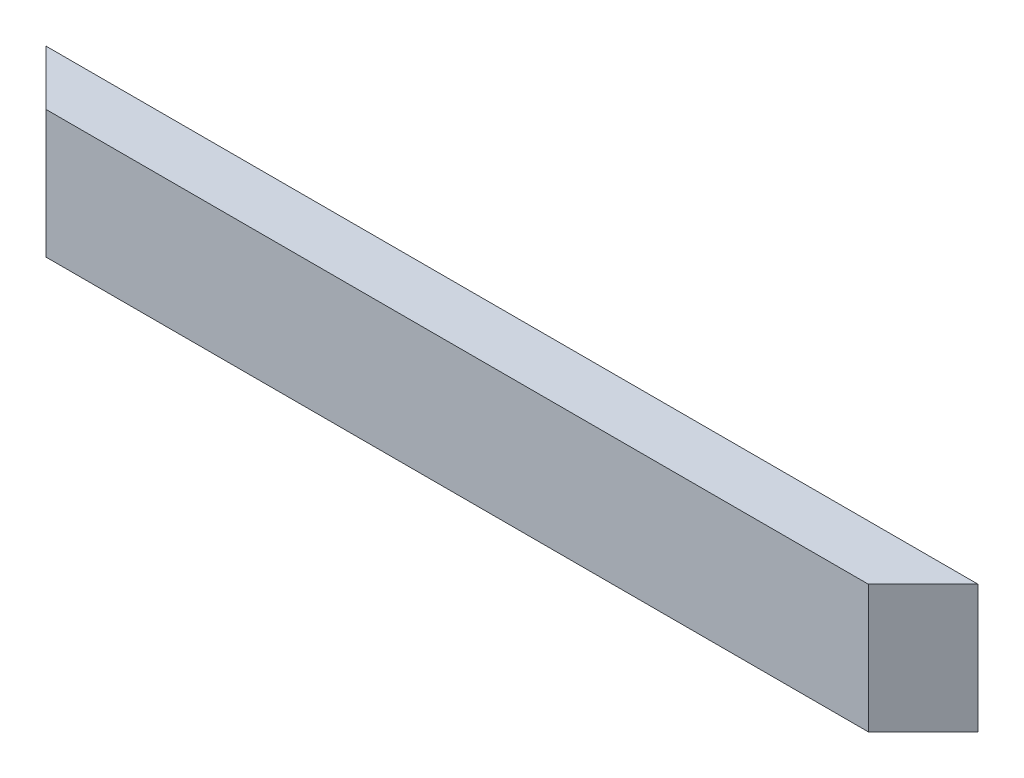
ISO-10303-21;
HEADER;
FILE_DESCRIPTION(('STEP AP214'),'2;1');
FILE_NAME('part.step','',(''),(''),'','','');
FILE_SCHEMA(('AUTOMOTIVE_DESIGN { 1 0 10303 214 1 1 1 1 }'));
ENDSEC;
DATA;
#1=APPLICATION_CONTEXT('core data for automotive mechanical design processes');
#2=APPLICATION_PROTOCOL_DEFINITION('international standard','automotive_design',2000,#1);
#3=PRODUCT_CONTEXT('',#1,'mechanical');
#4=PRODUCT('Part','Part','',(#3));
#5=PRODUCT_RELATED_PRODUCT_CATEGORY('part','',(#4));
#6=PRODUCT_DEFINITION_FORMATION('','',#4);
#7=PRODUCT_DEFINITION_CONTEXT('part definition',#1,'design');
#8=PRODUCT_DEFINITION('design','',#6,#7);
#9=PRODUCT_DEFINITION_SHAPE('','',#8);
#10=(LENGTH_UNIT() NAMED_UNIT(*) SI_UNIT(.MILLI.,.METRE.));
#11=(NAMED_UNIT(*) PLANE_ANGLE_UNIT() SI_UNIT($,.RADIAN.));
#12=(NAMED_UNIT(*) SI_UNIT($,.STERADIAN.) SOLID_ANGLE_UNIT());
#13=UNCERTAINTY_MEASURE_WITH_UNIT(LENGTH_MEASURE(1.E-05),#10,'distance_accuracy_value','');
#14=(GEOMETRIC_REPRESENTATION_CONTEXT(3) GLOBAL_UNCERTAINTY_ASSIGNED_CONTEXT((#13)) GLOBAL_UNIT_ASSIGNED_CONTEXT((#10,
#11,#12)) REPRESENTATION_CONTEXT('',''));
#15=CARTESIAN_POINT('',(0.,0.,0.));
#16=DIRECTION('',(0.,0.,1.));
#17=DIRECTION('',(1.,0.,0.));
#18=AXIS2_PLACEMENT_3D('',#15,#16,#17);
#19=CARTESIAN_POINT('',(323.85,88.9,-19.0500000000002));
#20=DIRECTION('',(0.,0.,1.));
#21=DIRECTION('',(1.,0.,0.));
#22=AXIS2_PLACEMENT_3D('',#19,#20,#21);
#23=PLANE('',#22);
#24=DIRECTION('',(-1.,0.,0.));
#25=VECTOR('',#24,1.);
#26=CARTESIAN_POINT('',(323.85,0.,-19.0500000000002));
#27=LINE('',#26,#25);
#28=CARTESIAN_POINT('',(323.85,0.,-19.0500000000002));
#29=VERTEX_POINT('',#28);
#30=CARTESIAN_POINT('',(-323.85,0.,-19.0500000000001));
#31=VERTEX_POINT('',#30);
#32=EDGE_CURVE('E93',#29,#31,#27,.T.);
#33=ORIENTED_EDGE('',*,*,#32,.T.);
#34=DIRECTION('',(0.,-1.,0.));
#35=VECTOR('',#34,1.);
#36=CARTESIAN_POINT('',(-323.85,88.9,-19.0500000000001));
#37=LINE('',#36,#35);
#38=CARTESIAN_POINT('',(-323.85,88.9,-19.0500000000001));
#39=VERTEX_POINT('',#38);
#40=EDGE_CURVE('E11',#39,#31,#37,.T.);
#41=ORIENTED_EDGE('',*,*,#40,.F.);
#42=DIRECTION('',(-1.,0.,0.));
#43=VECTOR('',#42,1.);
#44=CARTESIAN_POINT('',(323.85,88.9,-19.0500000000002));
#45=LINE('',#44,#43);
#46=CARTESIAN_POINT('',(323.85,88.9,-19.0500000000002));
#47=VERTEX_POINT('',#46);
#48=EDGE_CURVE('E81',#47,#39,#45,.T.);
#49=ORIENTED_EDGE('',*,*,#48,.F.);
#50=DIRECTION('',(0.,-1.,0.));
#51=VECTOR('',#50,1.);
#52=CARTESIAN_POINT('',(323.85,88.9,-19.0500000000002));
#53=LINE('',#52,#51);
#54=EDGE_CURVE('E89',#47,#29,#53,.T.);
#55=ORIENTED_EDGE('',*,*,#54,.T.);
#56=EDGE_LOOP('',(#33,#41,#49,#55));
#57=FACE_BOUND('',#56,.T.);
#58=ADVANCED_FACE('F30',(#57),#23,.F.);
#59=CARTESIAN_POINT('',(-323.85,88.9,-19.0500000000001));
#60=DIRECTION('',(0.707106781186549,0.,-0.707106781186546));
#61=DIRECTION('',(-0.707106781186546,0.,-0.707106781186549));
#62=AXIS2_PLACEMENT_3D('',#59,#60,#61);
#63=PLANE('',#62);
#64=DIRECTION('',(0.707106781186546,0.,0.707106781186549));
#65=VECTOR('',#64,1.);
#66=CARTESIAN_POINT('',(-323.85,0.,-19.0500000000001));
#67=LINE('',#66,#65);
#68=CARTESIAN_POINT('',(-285.75,0.,19.0499999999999));
#69=VERTEX_POINT('',#68);
#70=EDGE_CURVE('E85',#31,#69,#67,.T.);
#71=ORIENTED_EDGE('',*,*,#70,.T.);
#72=DIRECTION('',(0.,-1.,0.));
#73=VECTOR('',#72,1.);
#74=CARTESIAN_POINT('',(-285.75,88.9,19.0499999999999));
#75=LINE('',#74,#73);
#76=CARTESIAN_POINT('',(-285.75,88.9,19.0499999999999));
#77=VERTEX_POINT('',#76);
#78=EDGE_CURVE('E38',#77,#69,#75,.T.);
#79=ORIENTED_EDGE('',*,*,#78,.F.);
#80=DIRECTION('',(0.707106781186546,0.,0.707106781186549));
#81=VECTOR('',#80,1.);
#82=CARTESIAN_POINT('',(-323.85,88.9,-19.0500000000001));
#83=LINE('',#82,#81);
#84=EDGE_CURVE('E76',#39,#77,#83,.T.);
#85=ORIENTED_EDGE('',*,*,#84,.F.);
#86=ORIENTED_EDGE('',*,*,#40,.T.);
#87=EDGE_LOOP('',(#71,#79,#85,#86));
#88=FACE_BOUND('',#87,.T.);
#89=ADVANCED_FACE('F84',(#88),#63,.F.);
#90=CARTESIAN_POINT('',(-285.75,88.9,19.0499999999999));
#91=DIRECTION('',(0.,0.,-1.));
#92=DIRECTION('',(-1.,0.,0.));
#93=AXIS2_PLACEMENT_3D('',#90,#91,#92);
#94=PLANE('',#93);
#95=DIRECTION('',(1.,0.,0.));
#96=VECTOR('',#95,1.);
#97=CARTESIAN_POINT('',(-285.75,0.,19.0499999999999));
#98=LINE('',#97,#96);
#99=CARTESIAN_POINT('',(285.75,0.,19.0499999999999));
#100=VERTEX_POINT('',#99);
#101=EDGE_CURVE('E63',#69,#100,#98,.T.);
#102=ORIENTED_EDGE('',*,*,#101,.T.);
#103=DIRECTION('',(0.,-1.,0.));
#104=VECTOR('',#103,1.);
#105=CARTESIAN_POINT('',(285.75,88.9,19.0499999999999));
#106=LINE('',#105,#104);
#107=CARTESIAN_POINT('',(285.75,88.9,19.0499999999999));
#108=VERTEX_POINT('',#107);
#109=EDGE_CURVE('E86',#108,#100,#106,.T.);
#110=ORIENTED_EDGE('',*,*,#109,.F.);
#111=DIRECTION('',(1.,0.,0.));
#112=VECTOR('',#111,1.);
#113=CARTESIAN_POINT('',(-285.75,88.9,19.0499999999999));
#114=LINE('',#113,#112);
#115=EDGE_CURVE('E79',#77,#108,#114,.T.);
#116=ORIENTED_EDGE('',*,*,#115,.F.);
#117=ORIENTED_EDGE('',*,*,#78,.T.);
#118=EDGE_LOOP('',(#102,#110,#116,#117));
#119=FACE_BOUND('',#118,.T.);
#120=ADVANCED_FACE('F87',(#119),#94,.F.);
#121=CARTESIAN_POINT('',(285.75,88.9,19.0499999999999));
#122=DIRECTION('',(-0.707106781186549,0.,-0.707106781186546));
#123=DIRECTION('',(-0.707106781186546,0.,0.707106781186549));
#124=AXIS2_PLACEMENT_3D('',#121,#122,#123);
#125=PLANE('',#124);
#126=DIRECTION('',(0.707106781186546,0.,-0.707106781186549));
#127=VECTOR('',#126,1.);
#128=CARTESIAN_POINT('',(285.75,0.,19.0499999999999));
#129=LINE('',#128,#127);
#130=EDGE_CURVE('E69',#100,#29,#129,.T.);
#131=ORIENTED_EDGE('',*,*,#130,.T.);
#132=ORIENTED_EDGE('',*,*,#54,.F.);
#133=DIRECTION('',(0.707106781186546,0.,-0.707106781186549));
#134=VECTOR('',#133,1.);
#135=CARTESIAN_POINT('',(285.75,88.9,19.0499999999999));
#136=LINE('',#135,#134);
#137=EDGE_CURVE('E46',#108,#47,#136,.T.);
#138=ORIENTED_EDGE('',*,*,#137,.F.);
#139=ORIENTED_EDGE('',*,*,#109,.T.);
#140=EDGE_LOOP('',(#131,#132,#138,#139));
#141=FACE_BOUND('',#140,.T.);
#142=ADVANCED_FACE('F100',(#141),#125,.F.);
#143=CARTESIAN_POINT('',(-323.85,88.9,-19.0500000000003));
#144=DIRECTION('',(0.,1.,0.));
#145=DIRECTION('',(0.,0.,1.));
#146=AXIS2_PLACEMENT_3D('',#143,#144,#145);
#147=PLANE('',#146);
#148=ORIENTED_EDGE('',*,*,#48,.T.);
#149=ORIENTED_EDGE('',*,*,#84,.T.);
#150=ORIENTED_EDGE('',*,*,#115,.T.);
#151=ORIENTED_EDGE('',*,*,#137,.T.);
#152=EDGE_LOOP('',(#148,#149,#150,#151));
#153=FACE_BOUND('',#152,.T.);
#154=ADVANCED_FACE('F77',(#153),#147,.T.);
#155=CARTESIAN_POINT('',(-323.85,0.,-19.0500000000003));
#156=DIRECTION('',(0.,1.,0.));
#157=DIRECTION('',(0.,0.,1.));
#158=AXIS2_PLACEMENT_3D('',#155,#156,#157);
#159=PLANE('',#158);
#160=ORIENTED_EDGE('',*,*,#32,.F.);
#161=ORIENTED_EDGE('',*,*,#130,.F.);
#162=ORIENTED_EDGE('',*,*,#101,.F.);
#163=ORIENTED_EDGE('',*,*,#70,.F.);
#164=EDGE_LOOP('',(#160,#161,#162,#163));
#165=FACE_BOUND('',#164,.T.);
#166=ADVANCED_FACE('F103',(#165),#159,.F.);
#167=CLOSED_SHELL('',(#58,#89,#120,#142,#154,#166));
#168=MANIFOLD_SOLID_BREP('B2',#167);
#169=ADVANCED_BREP_SHAPE_REPRESENTATION('',(#18,#168),#14);
#170=SHAPE_DEFINITION_REPRESENTATION(#9,#169);
ENDSEC;
END-ISO-10303-21;
